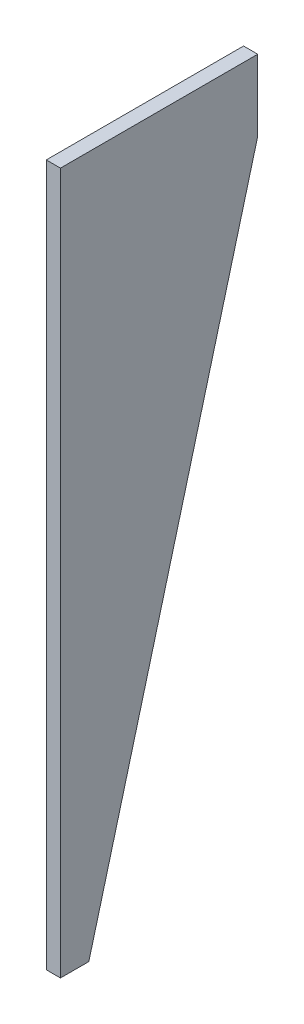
ISO-10303-21;
HEADER;
FILE_DESCRIPTION(('STEP AP214'),'2;1');
FILE_NAME('part.step','',(''),(''),'','','');
FILE_SCHEMA(('AUTOMOTIVE_DESIGN { 1 0 10303 214 1 1 1 1 }'));
ENDSEC;
DATA;
#1=APPLICATION_CONTEXT('core data for automotive mechanical design processes');
#2=APPLICATION_PROTOCOL_DEFINITION('international standard','automotive_design',2000,#1);
#3=PRODUCT_CONTEXT('',#1,'mechanical');
#4=PRODUCT('Part','Part','',(#3));
#5=PRODUCT_RELATED_PRODUCT_CATEGORY('part','',(#4));
#6=PRODUCT_DEFINITION_FORMATION('','',#4);
#7=PRODUCT_DEFINITION_CONTEXT('part definition',#1,'design');
#8=PRODUCT_DEFINITION('design','',#6,#7);
#9=PRODUCT_DEFINITION_SHAPE('','',#8);
#10=(LENGTH_UNIT() NAMED_UNIT(*) SI_UNIT(.MILLI.,.METRE.));
#11=(NAMED_UNIT(*) PLANE_ANGLE_UNIT() SI_UNIT($,.RADIAN.));
#12=(NAMED_UNIT(*) SI_UNIT($,.STERADIAN.) SOLID_ANGLE_UNIT());
#13=UNCERTAINTY_MEASURE_WITH_UNIT(LENGTH_MEASURE(1.E-05),#10,'distance_accuracy_value','');
#14=(GEOMETRIC_REPRESENTATION_CONTEXT(3) GLOBAL_UNCERTAINTY_ASSIGNED_CONTEXT((#13)) GLOBAL_UNIT_ASSIGNED_CONTEXT((#10,
#11,#12)) REPRESENTATION_CONTEXT('',''));
#15=CARTESIAN_POINT('',(0.,0.,0.));
#16=DIRECTION('',(0.,0.,1.));
#17=DIRECTION('',(1.,0.,0.));
#18=AXIS2_PLACEMENT_3D('',#15,#16,#17);
#19=CARTESIAN_POINT('',(273.224185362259,-353.209974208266,-531.805820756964));
#20=DIRECTION('',(0.,-1.,0.));
#21=DIRECTION('',(0.,0.,-1.));
#22=AXIS2_PLACEMENT_3D('',#19,#20,#21);
#23=PLANE('',#22);
#24=DIRECTION('',(-1.,0.,0.));
#25=VECTOR('',#24,1.);
#26=CARTESIAN_POINT('',(273.224185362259,-353.209974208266,-20.));
#27=LINE('',#26,#25);
#28=CARTESIAN_POINT('',(283.224185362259,-353.209974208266,-20.));
#29=VERTEX_POINT('',#28);
#30=CARTESIAN_POINT('',(273.224185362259,-353.209974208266,-20.));
#31=VERTEX_POINT('',#30);
#32=EDGE_CURVE('E11',#29,#31,#27,.T.);
#33=ORIENTED_EDGE('',*,*,#32,.F.);
#34=DIRECTION('',(0.,0.,1.));
#35=VECTOR('',#34,1.);
#36=CARTESIAN_POINT('',(283.224185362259,-353.209974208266,-531.805820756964));
#37=LINE('',#36,#35);
#38=CARTESIAN_POINT('',(283.224185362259,-353.209974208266,0.));
#39=VERTEX_POINT('',#38);
#40=EDGE_CURVE('E67',#29,#39,#37,.T.);
#41=ORIENTED_EDGE('',*,*,#40,.T.);
#42=DIRECTION('',(1.,0.,0.));
#43=VECTOR('',#42,1.);
#44=CARTESIAN_POINT('',(273.224185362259,-353.209974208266,0.));
#45=LINE('',#44,#43);
#46=CARTESIAN_POINT('',(273.224185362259,-353.209974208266,0.));
#47=VERTEX_POINT('',#46);
#48=EDGE_CURVE('E108',#47,#39,#45,.T.);
#49=ORIENTED_EDGE('',*,*,#48,.F.);
#50=DIRECTION('',(0.,0.,1.));
#51=VECTOR('',#50,1.);
#52=CARTESIAN_POINT('',(273.224185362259,-353.209974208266,-531.805820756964));
#53=LINE('',#52,#51);
#54=EDGE_CURVE('E61',#31,#47,#53,.T.);
#55=ORIENTED_EDGE('',*,*,#54,.F.);
#56=EDGE_LOOP('',(#33,#41,#49,#55));
#57=FACE_BOUND('',#56,.T.);
#58=ADVANCED_FACE('F33',(#57),#23,.T.);
#59=CARTESIAN_POINT('',(273.224185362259,-353.209974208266,-531.805820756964));
#60=DIRECTION('',(1.,0.,0.));
#61=DIRECTION('',(0.,0.,-1.));
#62=AXIS2_PLACEMENT_3D('',#59,#60,#61);
#63=PLANE('',#62);
#64=DIRECTION('',(0.,1.,0.));
#65=VECTOR('',#64,1.);
#66=CARTESIAN_POINT('',(273.224185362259,-353.209974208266,0.));
#67=LINE('',#66,#65);
#68=CARTESIAN_POINT('',(273.224185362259,141.115905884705,0.));
#69=VERTEX_POINT('',#68);
#70=EDGE_CURVE('E71',#47,#69,#67,.T.);
#71=ORIENTED_EDGE('',*,*,#70,.T.);
#72=DIRECTION('',(0.,0.,-1.));
#73=VECTOR('',#72,1.);
#74=CARTESIAN_POINT('',(273.224185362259,141.115905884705,-139.05676074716));
#75=LINE('',#74,#73);
#76=CARTESIAN_POINT('',(273.224185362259,141.115905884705,-139.05676074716));
#77=VERTEX_POINT('',#76);
#78=EDGE_CURVE('E112',#69,#77,#75,.T.);
#79=ORIENTED_EDGE('',*,*,#78,.T.);
#80=DIRECTION('',(0.,-1.,0.));
#81=VECTOR('',#80,1.);
#82=CARTESIAN_POINT('',(273.224185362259,91.1159058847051,-139.05676074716));
#83=LINE('',#82,#81);
#84=CARTESIAN_POINT('',(273.224185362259,91.1159058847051,-139.05676074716));
#85=VERTEX_POINT('',#84);
#86=EDGE_CURVE('E76',#77,#85,#83,.T.);
#87=ORIENTED_EDGE('',*,*,#86,.T.);
#88=DIRECTION('',(0.,-0.965925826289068,0.258819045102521));
#89=VECTOR('',#88,1.);
#90=CARTESIAN_POINT('',(273.224185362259,-225.258519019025,-54.2844890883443));
#91=LINE('',#90,#89);
#92=EDGE_CURVE('E37',#85,#31,#91,.T.);
#93=ORIENTED_EDGE('',*,*,#92,.T.);
#94=ORIENTED_EDGE('',*,*,#54,.T.);
#95=EDGE_LOOP('',(#71,#79,#87,#93,#94));
#96=FACE_BOUND('',#95,.T.);
#97=ADVANCED_FACE('F126',(#96),#63,.F.);
#98=CARTESIAN_POINT('',(283.224185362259,-353.209974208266,-531.805820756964));
#99=DIRECTION('',(1.,0.,0.));
#100=DIRECTION('',(0.,1.,0.));
#101=AXIS2_PLACEMENT_3D('',#98,#99,#100);
#102=PLANE('',#101);
#103=DIRECTION('',(0.,-0.965925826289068,0.258819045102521));
#104=VECTOR('',#103,1.);
#105=CARTESIAN_POINT('',(283.224185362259,-225.258519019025,-54.2844890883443));
#106=LINE('',#105,#104);
#107=CARTESIAN_POINT('',(283.224185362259,91.1159058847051,-139.05676074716));
#108=VERTEX_POINT('',#107);
#109=EDGE_CURVE('E43',#108,#29,#106,.T.);
#110=ORIENTED_EDGE('',*,*,#109,.F.);
#111=DIRECTION('',(0.,1.,0.));
#112=VECTOR('',#111,1.);
#113=CARTESIAN_POINT('',(283.224185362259,91.1159058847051,-139.05676074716));
#114=LINE('',#113,#112);
#115=CARTESIAN_POINT('',(283.224185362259,141.115905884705,-139.05676074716));
#116=VERTEX_POINT('',#115);
#117=EDGE_CURVE('E90',#108,#116,#114,.T.);
#118=ORIENTED_EDGE('',*,*,#117,.T.);
#119=DIRECTION('',(0.,0.,1.));
#120=VECTOR('',#119,1.);
#121=CARTESIAN_POINT('',(283.224185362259,141.115905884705,-139.05676074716));
#122=LINE('',#121,#120);
#123=CARTESIAN_POINT('',(283.224185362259,141.115905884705,0.));
#124=VERTEX_POINT('',#123);
#125=EDGE_CURVE('E100',#116,#124,#122,.T.);
#126=ORIENTED_EDGE('',*,*,#125,.T.);
#127=DIRECTION('',(0.,1.,0.));
#128=VECTOR('',#127,1.);
#129=CARTESIAN_POINT('',(283.224185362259,-353.209974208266,0.));
#130=LINE('',#129,#128);
#131=EDGE_CURVE('E102',#39,#124,#130,.T.);
#132=ORIENTED_EDGE('',*,*,#131,.F.);
#133=ORIENTED_EDGE('',*,*,#40,.F.);
#134=EDGE_LOOP('',(#110,#118,#126,#132,#133));
#135=FACE_BOUND('',#134,.T.);
#136=ADVANCED_FACE('F104',(#135),#102,.T.);
#137=CARTESIAN_POINT('',(0.,0.,0.));
#138=DIRECTION('',(0.,0.,1.));
#139=DIRECTION('',(1.,0.,0.));
#140=AXIS2_PLACEMENT_3D('',#137,#138,#139);
#141=PLANE('',#140);
#142=ORIENTED_EDGE('',*,*,#48,.T.);
#143=ORIENTED_EDGE('',*,*,#131,.T.);
#144=DIRECTION('',(1.,0.,0.));
#145=VECTOR('',#144,1.);
#146=CARTESIAN_POINT('',(125.451445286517,141.115905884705,0.));
#147=LINE('',#146,#145);
#148=EDGE_CURVE('E114',#69,#124,#147,.T.);
#149=ORIENTED_EDGE('',*,*,#148,.F.);
#150=ORIENTED_EDGE('',*,*,#70,.F.);
#151=EDGE_LOOP('',(#142,#143,#149,#150));
#152=FACE_BOUND('',#151,.T.);
#153=ADVANCED_FACE('F124',(#152),#141,.T.);
#154=CARTESIAN_POINT('',(53.2241853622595,-131.04703416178,-79.5283803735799));
#155=DIRECTION('',(0.,0.258819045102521,0.965925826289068));
#156=DIRECTION('',(1.,0.,0.));
#157=AXIS2_PLACEMENT_3D('',#154,#155,#156);
#158=PLANE('',#157);
#159=DIRECTION('',(1.,0.,0.));
#160=VECTOR('',#159,1.);
#161=CARTESIAN_POINT('',(283.224185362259,91.1159058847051,-139.05676074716));
#162=LINE('',#161,#160);
#163=EDGE_CURVE('E93',#85,#108,#162,.T.);
#164=ORIENTED_EDGE('',*,*,#163,.T.);
#165=ORIENTED_EDGE('',*,*,#109,.T.);
#166=ORIENTED_EDGE('',*,*,#32,.T.);
#167=ORIENTED_EDGE('',*,*,#92,.F.);
#168=EDGE_LOOP('',(#164,#165,#166,#167));
#169=FACE_BOUND('',#168,.T.);
#170=ADVANCED_FACE('F35',(#169),#158,.F.);
#171=CARTESIAN_POINT('',(125.451445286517,141.115905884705,-139.05676074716));
#172=DIRECTION('',(0.,1.,0.));
#173=DIRECTION('',(-1.,0.,0.));
#174=AXIS2_PLACEMENT_3D('',#171,#172,#173);
#175=PLANE('',#174);
#176=ORIENTED_EDGE('',*,*,#78,.F.);
#177=ORIENTED_EDGE('',*,*,#148,.T.);
#178=ORIENTED_EDGE('',*,*,#125,.F.);
#179=DIRECTION('',(1.,0.,0.));
#180=VECTOR('',#179,1.);
#181=CARTESIAN_POINT('',(125.451445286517,141.115905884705,-139.05676074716));
#182=LINE('',#181,#180);
#183=EDGE_CURVE('E95',#77,#116,#182,.T.);
#184=ORIENTED_EDGE('',*,*,#183,.F.);
#185=EDGE_LOOP('',(#176,#177,#178,#184));
#186=FACE_BOUND('',#185,.T.);
#187=ADVANCED_FACE('F121',(#186),#175,.T.);
#188=CARTESIAN_POINT('',(125.451445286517,91.1159058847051,-139.05676074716));
#189=DIRECTION('',(0.,0.,-1.));
#190=DIRECTION('',(-1.,0.,0.));
#191=AXIS2_PLACEMENT_3D('',#188,#189,#190);
#192=PLANE('',#191);
#193=ORIENTED_EDGE('',*,*,#86,.F.);
#194=ORIENTED_EDGE('',*,*,#183,.T.);
#195=ORIENTED_EDGE('',*,*,#117,.F.);
#196=ORIENTED_EDGE('',*,*,#163,.F.);
#197=EDGE_LOOP('',(#193,#194,#195,#196));
#198=FACE_BOUND('',#197,.T.);
#199=ADVANCED_FACE('F92',(#198),#192,.T.);
#200=CLOSED_SHELL('',(#58,#97,#136,#153,#170,#187,#199));
#201=MANIFOLD_SOLID_BREP('B2',#200);
#202=ADVANCED_BREP_SHAPE_REPRESENTATION('',(#18,#201),#14);
#203=SHAPE_DEFINITION_REPRESENTATION(#9,#202);
ENDSEC;
END-ISO-10303-21;
